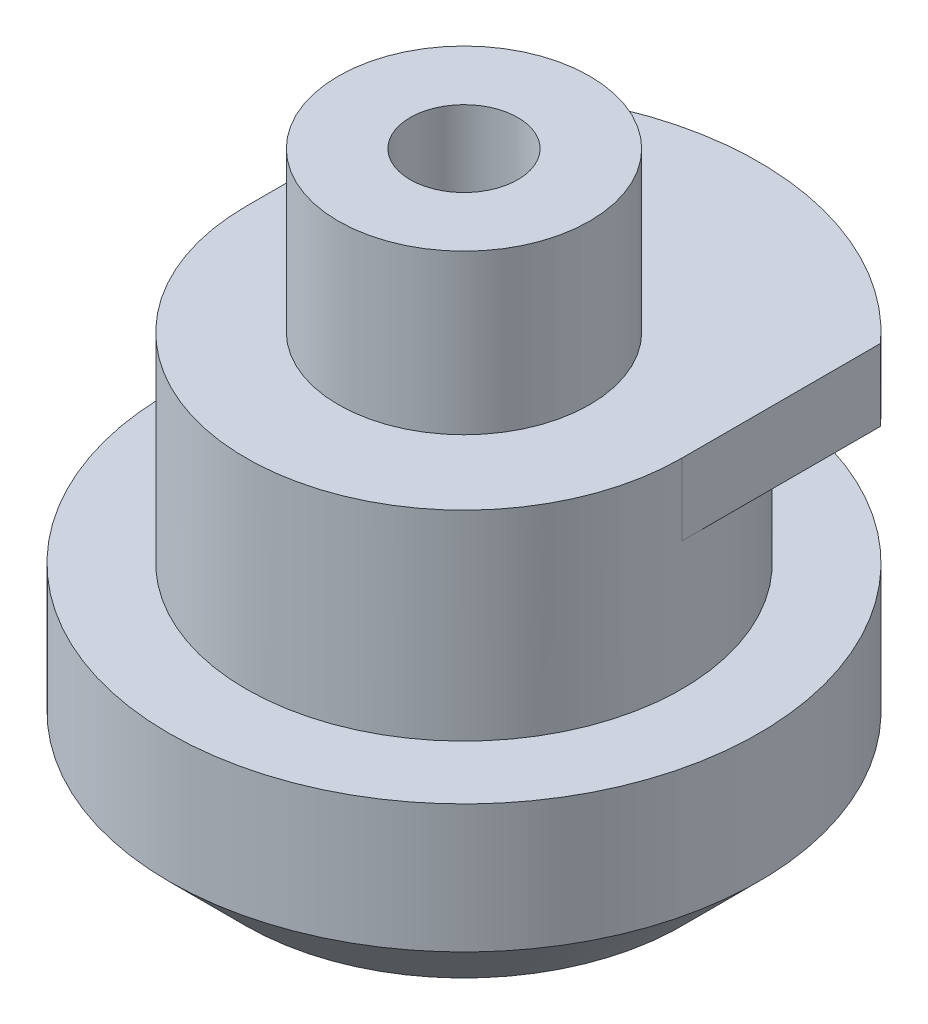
from build123d import *

# Parameters (mm, degrees)
SKETCH1_R      = 11.5
EXTRUDE1_DEPTH = 8
CHAMFER1_SIZE  = 3
SKETCH2_R      = 8.5
EXTRUDE2_DEPTH = 7.8
SKETCH3_R      = 4.9
EXTRUDE3_DEPTH = 6.2
SKETCH6_R      = 2.5
EXTRUDE4_DEPTH = 13.5
SKETCH7_R      = 2.1
EXTRUDE5_DEPTH = 28.358728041
EXTRUDE6_START = -2.8
SKETCH8_R      = 6.9512359
EXTRUDE6_DEPTH = 2.8


with BuildPart() as part:
    # Sketch1 → Extrude1 (new body)
    with BuildSketch(Plane(origin=(0, 0, 0), x_dir=(1, 0, 0), z_dir=(0, 1, 0))):
        with Locations(Location((0, 0, 0), (0, 0, 270))):
            Circle(SKETCH1_R)
    extrude(amount=EXTRUDE1_DEPTH)

    # Chamfer1
    chamfer1_edges = [part.edges().sort_by_distance(p)[0] for p in [
        (0, 0, -11.5),
    ]]
    chamfer(chamfer1_edges, length=CHAMFER1_SIZE)

    # Sketch2 → Extrude2 (add)
    with BuildSketch(Plane(origin=(0, 8, 0), x_dir=(1, 0, 0), z_dir=(0, 1, 0))):
        with Locations(Location((0, 0, 0), (0, 0, 270))):
            Circle(SKETCH2_R)
    extrude(amount=EXTRUDE2_DEPTH)

    # Sketch3 → Extrude3 (add)
    with BuildSketch(Plane(origin=(0, 15.8, 0), x_dir=(1, 0, 0), z_dir=(0, 1, 0))):
        with Locations(Location((0, 0, 0), (0, 0, 90))):
            Circle(SKETCH3_R)
    extrude(amount=EXTRUDE3_DEPTH)

    # Sketch6 → Extrude4 (cut)
    with BuildSketch(Plane.XZ):
        with Locations(Location((0, 0, 0), (0, 0, 270))):
            Circle(SKETCH6_R)
    extrude(amount=-EXTRUDE4_DEPTH, mode=Mode.SUBTRACT)

    # Sketch7 → Extrude5 (cut, through all)
    with BuildSketch(Plane(origin=(0, 22, 0), x_dir=(1, 0, 0), z_dir=(0, 1, 0))):
        with Locations(Location((0, 0, 0), (0, 0, 270))):
            Circle(SKETCH7_R)
    extrude(amount=-EXTRUDE5_DEPTH, mode=Mode.SUBTRACT)

    # Sketch8 → Extrude6 (add)
    with BuildSketch(Plane(origin=(0, 15.8, 0), x_dir=(1, 0, 0), z_dir=(0, 1, 0)).offset(EXTRUDE6_START)):
        with BuildLine():
            Line((8.5, 0), (8.5, 7.745966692))
            ThreePointArc((8.5, 7.745966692), (0, 11.5), (-8.5, 7.745966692))
            Line((-8.5, 7.745966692), (-8.5, 0))
            ThreePointArc((-8.5, 0), (0, -8.5), (8.5, 0))
        make_face()
        Circle(SKETCH8_R, mode=Mode.SUBTRACT)
    extrude(amount=EXTRUDE6_DEPTH)


solid = part.part
